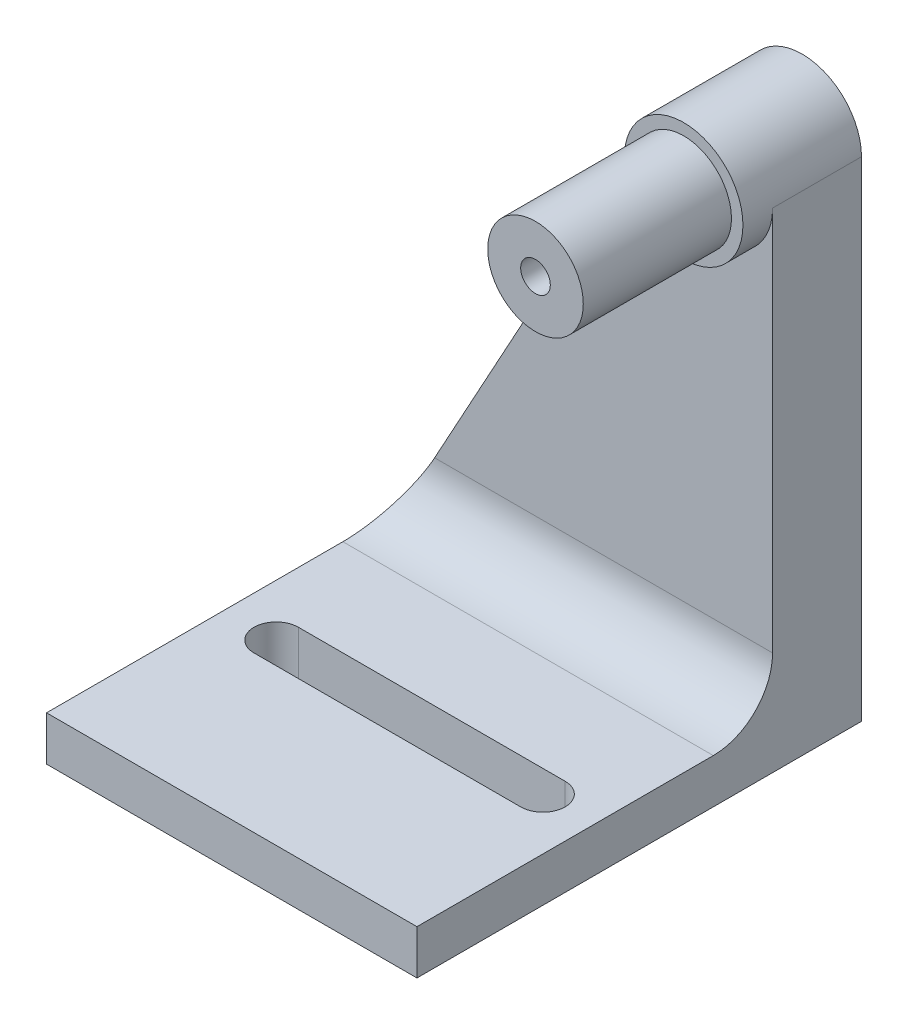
ISO-10303-21;
HEADER;
FILE_DESCRIPTION(('STEP AP214'),'2;1');
FILE_NAME('part.step','',(''),(''),'','','');
FILE_SCHEMA(('AUTOMOTIVE_DESIGN { 1 0 10303 214 1 1 1 1 }'));
ENDSEC;
DATA;
#1=APPLICATION_CONTEXT('core data for automotive mechanical design processes');
#2=APPLICATION_PROTOCOL_DEFINITION('international standard','automotive_design',2000,#1);
#3=PRODUCT_CONTEXT('',#1,'mechanical');
#4=PRODUCT('Part','Part','',(#3));
#5=PRODUCT_RELATED_PRODUCT_CATEGORY('part','',(#4));
#6=PRODUCT_DEFINITION_FORMATION('','',#4);
#7=PRODUCT_DEFINITION_CONTEXT('part definition',#1,'design');
#8=PRODUCT_DEFINITION('design','',#6,#7);
#9=PRODUCT_DEFINITION_SHAPE('','',#8);
#10=(LENGTH_UNIT() NAMED_UNIT(*) SI_UNIT(.MILLI.,.METRE.));
#11=(NAMED_UNIT(*) PLANE_ANGLE_UNIT() SI_UNIT($,.RADIAN.));
#12=(NAMED_UNIT(*) SI_UNIT($,.STERADIAN.) SOLID_ANGLE_UNIT());
#13=UNCERTAINTY_MEASURE_WITH_UNIT(LENGTH_MEASURE(1.E-05),#10,'distance_accuracy_value','');
#14=(GEOMETRIC_REPRESENTATION_CONTEXT(3) GLOBAL_UNCERTAINTY_ASSIGNED_CONTEXT((#13)) GLOBAL_UNIT_ASSIGNED_CONTEXT((#10,
#11,#12)) REPRESENTATION_CONTEXT('',''));
#15=CARTESIAN_POINT('',(0.,0.,0.));
#16=DIRECTION('',(0.,0.,1.));
#17=DIRECTION('',(1.,0.,0.));
#18=AXIS2_PLACEMENT_3D('',#15,#16,#17);
#19=CARTESIAN_POINT('',(0.,0.,6.));
#20=DIRECTION('',(-1.,0.,0.));
#21=DIRECTION('',(0.,0.,1.));
#22=AXIS2_PLACEMENT_3D('',#19,#20,#21);
#23=PLANE('',#22);
#24=DIRECTION('',(0.,1.,0.));
#25=VECTOR('',#24,1.);
#26=CARTESIAN_POINT('',(0.,0.,6.));
#27=LINE('',#26,#25);
#28=CARTESIAN_POINT('',(0.,4.,6.));
#29=VERTEX_POINT('',#28);
#30=CARTESIAN_POINT('',(0.,30.,6.));
#31=VERTEX_POINT('',#30);
#32=EDGE_CURVE('E229',#29,#31,#27,.T.);
#33=ORIENTED_EDGE('',*,*,#32,.F.);
#34=CARTESIAN_POINT('',(0.,4.,10.));
#35=DIRECTION('',(-1.,0.,0.));
#36=DIRECTION('',(0.,0.,1.));
#37=AXIS2_PLACEMENT_3D('',#34,#35,#36);
#38=CIRCLE('',#37,4.);
#39=CARTESIAN_POINT('',(0.,0.,10.));
#40=VERTEX_POINT('',#39);
#41=EDGE_CURVE('E11',#29,#40,#38,.T.);
#42=ORIENTED_EDGE('',*,*,#41,.T.);
#43=DIRECTION('',(0.,0.,-1.));
#44=VECTOR('',#43,1.);
#45=CARTESIAN_POINT('',(0.,0.,30.));
#46=LINE('',#45,#44);
#47=CARTESIAN_POINT('',(0.,0.,30.));
#48=VERTEX_POINT('',#47);
#49=EDGE_CURVE('E203',#48,#40,#46,.T.);
#50=ORIENTED_EDGE('',*,*,#49,.F.);
#51=DIRECTION('',(0.,-1.,0.));
#52=VECTOR('',#51,1.);
#53=CARTESIAN_POINT('',(0.,-3.,30.));
#54=LINE('',#53,#52);
#55=CARTESIAN_POINT('',(0.,-3.,30.));
#56=VERTEX_POINT('',#55);
#57=EDGE_CURVE('E186',#48,#56,#54,.T.);
#58=ORIENTED_EDGE('',*,*,#57,.T.);
#59=DIRECTION('',(0.,0.,-1.));
#60=VECTOR('',#59,1.);
#61=CARTESIAN_POINT('',(0.,-3.,6.));
#62=LINE('',#61,#60);
#63=CARTESIAN_POINT('',(0.,-3.,0.));
#64=VERTEX_POINT('',#63);
#65=EDGE_CURVE('E236',#56,#64,#62,.T.);
#66=ORIENTED_EDGE('',*,*,#65,.T.);
#67=DIRECTION('',(0.,1.,0.));
#68=VECTOR('',#67,1.);
#69=CARTESIAN_POINT('',(0.,0.,0.));
#70=LINE('',#69,#68);
#71=CARTESIAN_POINT('',(0.,30.,0.));
#72=VERTEX_POINT('',#71);
#73=EDGE_CURVE('E224',#64,#72,#70,.T.);
#74=ORIENTED_EDGE('',*,*,#73,.T.);
#75=DIRECTION('',(0.,0.,-1.));
#76=VECTOR('',#75,1.);
#77=CARTESIAN_POINT('',(0.,30.,6.));
#78=LINE('',#77,#76);
#79=EDGE_CURVE('E228',#31,#72,#78,.T.);
#80=ORIENTED_EDGE('',*,*,#79,.F.);
#81=EDGE_LOOP('',(#33,#42,#50,#58,#66,#74,#80));
#82=FACE_BOUND('',#81,.T.);
#83=ADVANCED_FACE('F41',(#82),#23,.F.);
#84=CARTESIAN_POINT('',(-4.,30.,6.));
#85=DIRECTION('',(0.,0.,-1.));
#86=DIRECTION('',(-1.,0.,0.));
#87=AXIS2_PLACEMENT_3D('',#84,#85,#86);
#88=CYLINDRICAL_SURFACE('',#87,4.);
#89=CARTESIAN_POINT('',(-4.,30.,0.));
#90=DIRECTION('',(0.,0.,1.));
#91=DIRECTION('',(1.,0.,0.));
#92=AXIS2_PLACEMENT_3D('',#89,#90,#91);
#93=CIRCLE('',#92,4.);
#94=CARTESIAN_POINT('',(-7.50787914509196,31.922182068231,0.));
#95=VERTEX_POINT('',#94);
#96=EDGE_CURVE('E239',#72,#95,#93,.T.);
#97=ORIENTED_EDGE('',*,*,#96,.T.);
#98=DIRECTION('',(0.,0.,-1.));
#99=VECTOR('',#98,1.);
#100=CARTESIAN_POINT('',(-7.50787914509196,31.922182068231,6.));
#101=LINE('',#100,#99);
#102=CARTESIAN_POINT('',(-7.50787914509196,31.922182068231,6.));
#103=VERTEX_POINT('',#102);
#104=EDGE_CURVE('E261',#103,#95,#101,.T.);
#105=ORIENTED_EDGE('',*,*,#104,.F.);
#106=CARTESIAN_POINT('',(-4.,30.,6.));
#107=DIRECTION('',(0.,0.,1.));
#108=DIRECTION('',(1.,0.,0.));
#109=AXIS2_PLACEMENT_3D('',#106,#107,#108);
#110=CIRCLE('',#109,4.);
#111=EDGE_CURVE('E220',#103,#31,#110,.T.);
#112=ORIENTED_EDGE('',*,*,#111,.T.);
#113=ORIENTED_EDGE('',*,*,#79,.T.);
#114=EDGE_LOOP('',(#97,#105,#112,#113));
#115=FACE_BOUND('',#114,.T.);
#116=CARTESIAN_POINT('',(-4.,30.,8.));
#117=DIRECTION('',(0.,0.,1.));
#118=DIRECTION('',(1.,0.,0.));
#119=AXIS2_PLACEMENT_3D('',#116,#117,#118);
#120=CIRCLE('',#119,4.);
#121=CARTESIAN_POINT('',(0.,30.,8.));
#122=VERTEX_POINT('',#121);
#123=EDGE_CURVE('E214',#122,#122,#120,.T.);
#124=ORIENTED_EDGE('',*,*,#123,.F.);
#125=EDGE_LOOP('',(#124));
#126=FACE_BOUND('',#125,.T.);
#127=ADVANCED_FACE('F301',(#115,#126),#88,.T.);
#128=CARTESIAN_POINT('',(-19.2269001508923,10.5355974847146,6.));
#129=DIRECTION('',(0.876969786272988,-0.480545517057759,0.));
#130=DIRECTION('',(0.480545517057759,0.876969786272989,0.));
#131=AXIS2_PLACEMENT_3D('',#128,#129,#130);
#132=PLANE('',#131);
#133=DIRECTION('',(-0.480545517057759,-0.876969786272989,0.));
#134=VECTOR('',#133,1.);
#135=CARTESIAN_POINT('',(-19.2269001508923,10.5355974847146,0.));
#136=LINE('',#135,#134);
#137=CARTESIAN_POINT('',(-25.,0.,0.));
#138=VERTEX_POINT('',#137);
#139=EDGE_CURVE('E242',#95,#138,#136,.T.);
#140=ORIENTED_EDGE('',*,*,#139,.T.);
#141=DIRECTION('',(0.,0.,-1.));
#142=VECTOR('',#141,1.);
#143=CARTESIAN_POINT('',(-25.,0.,6.));
#144=LINE('',#143,#142);
#145=CARTESIAN_POINT('',(-25.,0.,10.));
#146=VERTEX_POINT('',#145);
#147=EDGE_CURVE('E257',#146,#138,#144,.T.);
#148=ORIENTED_EDGE('',*,*,#147,.F.);
#149=CARTESIAN_POINT('',(-22.8081547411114,4.,10.));
#150=DIRECTION('',(0.876969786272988,-0.480545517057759,0.));
#151=DIRECTION('',(0.480545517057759,0.876969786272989,0.));
#152=AXIS2_PLACEMENT_3D('',#149,#150,#151);
#153=ELLIPSE('',#152,4.56116055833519,4.);
#154=CARTESIAN_POINT('',(-22.8081547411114,4.,6.));
#155=VERTEX_POINT('',#154);
#156=EDGE_CURVE('E51',#146,#155,#153,.T.);
#157=ORIENTED_EDGE('',*,*,#156,.T.);
#158=DIRECTION('',(-0.480545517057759,-0.876969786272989,0.));
#159=VECTOR('',#158,1.);
#160=CARTESIAN_POINT('',(-19.2269001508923,10.5355974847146,6.));
#161=LINE('',#160,#159);
#162=EDGE_CURVE('E232',#103,#155,#161,.T.);
#163=ORIENTED_EDGE('',*,*,#162,.F.);
#164=ORIENTED_EDGE('',*,*,#104,.T.);
#165=EDGE_LOOP('',(#140,#148,#157,#163,#164));
#166=FACE_BOUND('',#165,.T.);
#167=ADVANCED_FACE('F303',(#166),#132,.F.);
#168=CARTESIAN_POINT('',(-25.,0.,6.));
#169=DIRECTION('',(1.,0.,0.));
#170=DIRECTION('',(0.,0.,-1.));
#171=AXIS2_PLACEMENT_3D('',#168,#169,#170);
#172=PLANE('',#171);
#173=DIRECTION('',(0.,-1.,0.));
#174=VECTOR('',#173,1.);
#175=CARTESIAN_POINT('',(-25.,0.,0.));
#176=LINE('',#175,#174);
#177=CARTESIAN_POINT('',(-25.,-3.,0.));
#178=VERTEX_POINT('',#177);
#179=EDGE_CURVE('E245',#138,#178,#176,.T.);
#180=ORIENTED_EDGE('',*,*,#179,.T.);
#181=DIRECTION('',(0.,0.,-1.));
#182=VECTOR('',#181,1.);
#183=CARTESIAN_POINT('',(-25.,-3.,6.));
#184=LINE('',#183,#182);
#185=CARTESIAN_POINT('',(-25.,-3.,30.));
#186=VERTEX_POINT('',#185);
#187=EDGE_CURVE('E253',#186,#178,#184,.T.);
#188=ORIENTED_EDGE('',*,*,#187,.F.);
#189=DIRECTION('',(0.,1.,0.));
#190=VECTOR('',#189,1.);
#191=CARTESIAN_POINT('',(-25.,-3.,30.));
#192=LINE('',#191,#190);
#193=CARTESIAN_POINT('',(-25.,0.,30.));
#194=VERTEX_POINT('',#193);
#195=EDGE_CURVE('E194',#186,#194,#192,.T.);
#196=ORIENTED_EDGE('',*,*,#195,.T.);
#197=DIRECTION('',(0.,0.,-1.));
#198=VECTOR('',#197,1.);
#199=CARTESIAN_POINT('',(-25.,0.,30.));
#200=LINE('',#199,#198);
#201=EDGE_CURVE('E202',#194,#146,#200,.T.);
#202=ORIENTED_EDGE('',*,*,#201,.T.);
#203=ORIENTED_EDGE('',*,*,#147,.T.);
#204=EDGE_LOOP('',(#180,#188,#196,#202,#203));
#205=FACE_BOUND('',#204,.T.);
#206=ADVANCED_FACE('F284',(#205),#172,.F.);
#207=CARTESIAN_POINT('',(0.,-3.,6.));
#208=DIRECTION('',(0.,1.,0.));
#209=DIRECTION('',(0.,0.,1.));
#210=AXIS2_PLACEMENT_3D('',#207,#208,#209);
#211=PLANE('',#210);
#212=DIRECTION('',(-1.,0.,0.));
#213=VECTOR('',#212,1.);
#214=CARTESIAN_POINT('',(0.,-3.,16.5));
#215=LINE('',#214,#213);
#216=CARTESIAN_POINT('',(-3.5,-3.,16.5));
#217=VERTEX_POINT('',#216);
#218=CARTESIAN_POINT('',(-21.5,-3.,16.5));
#219=VERTEX_POINT('',#218);
#220=EDGE_CURVE('E170',#217,#219,#215,.T.);
#221=ORIENTED_EDGE('',*,*,#220,.T.);
#222=CARTESIAN_POINT('',(-21.5,-3.,18.));
#223=DIRECTION('',(0.,1.,0.));
#224=DIRECTION('',(0.,0.,1.));
#225=AXIS2_PLACEMENT_3D('',#222,#223,#224);
#226=CIRCLE('',#225,1.5);
#227=CARTESIAN_POINT('',(-21.5,-3.,19.5));
#228=VERTEX_POINT('',#227);
#229=EDGE_CURVE('E174',#219,#228,#226,.T.);
#230=ORIENTED_EDGE('',*,*,#229,.T.);
#231=DIRECTION('',(1.,0.,0.));
#232=VECTOR('',#231,1.);
#233=CARTESIAN_POINT('',(0.,-3.,19.5));
#234=LINE('',#233,#232);
#235=CARTESIAN_POINT('',(-3.5,-3.,19.5));
#236=VERTEX_POINT('',#235);
#237=EDGE_CURVE('E161',#228,#236,#234,.T.);
#238=ORIENTED_EDGE('',*,*,#237,.T.);
#239=CARTESIAN_POINT('',(-3.5,-3.,18.));
#240=DIRECTION('',(0.,1.,0.));
#241=DIRECTION('',(0.,0.,1.));
#242=AXIS2_PLACEMENT_3D('',#239,#240,#241);
#243=CIRCLE('',#242,1.5);
#244=EDGE_CURVE('E131',#236,#217,#243,.T.);
#245=ORIENTED_EDGE('',*,*,#244,.T.);
#246=EDGE_LOOP('',(#221,#230,#238,#245));
#247=FACE_BOUND('',#246,.T.);
#248=DIRECTION('',(1.,0.,0.));
#249=VECTOR('',#248,1.);
#250=CARTESIAN_POINT('',(0.,-3.,0.));
#251=LINE('',#250,#249);
#252=EDGE_CURVE('E233',#178,#64,#251,.T.);
#253=ORIENTED_EDGE('',*,*,#252,.T.);
#254=ORIENTED_EDGE('',*,*,#65,.F.);
#255=DIRECTION('',(-1.,0.,0.));
#256=VECTOR('',#255,1.);
#257=CARTESIAN_POINT('',(0.,-3.,30.));
#258=LINE('',#257,#256);
#259=EDGE_CURVE('E190',#56,#186,#258,.T.);
#260=ORIENTED_EDGE('',*,*,#259,.T.);
#261=ORIENTED_EDGE('',*,*,#187,.T.);
#262=EDGE_LOOP('',(#253,#254,#260,#261));
#263=FACE_BOUND('',#262,.T.);
#264=ADVANCED_FACE('F310',(#247,#263),#211,.F.);
#265=CARTESIAN_POINT('',(0.,0.,6.));
#266=DIRECTION('',(0.,0.,1.));
#267=DIRECTION('',(1.,0.,0.));
#268=AXIS2_PLACEMENT_3D('',#265,#266,#267);
#269=PLANE('',#268);
#270=ORIENTED_EDGE('',*,*,#162,.T.);
#271=DIRECTION('',(-1.,0.,0.));
#272=VECTOR('',#271,1.);
#273=CARTESIAN_POINT('',(0.,4.,6.));
#274=LINE('',#273,#272);
#275=EDGE_CURVE('E271',#155,#29,#274,.F.);
#276=ORIENTED_EDGE('',*,*,#275,.T.);
#277=ORIENTED_EDGE('',*,*,#32,.T.);
#278=ORIENTED_EDGE('',*,*,#111,.F.);
#279=EDGE_LOOP('',(#270,#276,#277,#278));
#280=FACE_BOUND('',#279,.T.);
#281=ADVANCED_FACE('F277',(#280),#269,.T.);
#282=CARTESIAN_POINT('',(0.,0.,0.));
#283=DIRECTION('',(0.,0.,1.));
#284=DIRECTION('',(1.,0.,0.));
#285=AXIS2_PLACEMENT_3D('',#282,#283,#284);
#286=PLANE('',#285);
#287=CARTESIAN_POINT('',(-4.,30.,0.));
#288=DIRECTION('',(0.,0.,1.));
#289=DIRECTION('',(1.,0.,0.));
#290=AXIS2_PLACEMENT_3D('',#287,#288,#289);
#291=CIRCLE('',#290,1.);
#292=CARTESIAN_POINT('',(-3.,30.,0.));
#293=VERTEX_POINT('',#292);
#294=EDGE_CURVE('E182',#293,#293,#291,.T.);
#295=ORIENTED_EDGE('',*,*,#294,.T.);
#296=EDGE_LOOP('',(#295));
#297=FACE_BOUND('',#296,.T.);
#298=ORIENTED_EDGE('',*,*,#96,.F.);
#299=ORIENTED_EDGE('',*,*,#73,.F.);
#300=ORIENTED_EDGE('',*,*,#252,.F.);
#301=ORIENTED_EDGE('',*,*,#179,.F.);
#302=ORIENTED_EDGE('',*,*,#139,.F.);
#303=EDGE_LOOP('',(#298,#299,#300,#301,#302));
#304=FACE_BOUND('',#303,.T.);
#305=ADVANCED_FACE('F297',(#297,#304),#286,.F.);
#306=CARTESIAN_POINT('',(-4.,30.,8.));
#307=DIRECTION('',(0.,0.,1.));
#308=DIRECTION('',(1.,0.,0.));
#309=AXIS2_PLACEMENT_3D('',#306,#307,#308);
#310=PLANE('',#309);
#311=CARTESIAN_POINT('',(-4.,30.,8.));
#312=DIRECTION('',(0.,0.,1.));
#313=DIRECTION('',(1.,0.,0.));
#314=AXIS2_PLACEMENT_3D('',#311,#312,#313);
#315=CIRCLE('',#314,3.225);
#316=CARTESIAN_POINT('',(-0.775,30.,8.));
#317=VERTEX_POINT('',#316);
#318=EDGE_CURVE('E215',#317,#317,#315,.T.);
#319=ORIENTED_EDGE('',*,*,#318,.F.);
#320=EDGE_LOOP('',(#319));
#321=FACE_BOUND('',#320,.T.);
#322=ORIENTED_EDGE('',*,*,#123,.T.);
#323=EDGE_LOOP('',(#322));
#324=FACE_BOUND('',#323,.T.);
#325=ADVANCED_FACE('F329',(#321,#324),#310,.T.);
#326=CARTESIAN_POINT('',(-4.,30.,18.));
#327=DIRECTION('',(0.,0.,-1.));
#328=DIRECTION('',(-1.,0.,0.));
#329=AXIS2_PLACEMENT_3D('',#326,#327,#328);
#330=CYLINDRICAL_SURFACE('',#329,3.225);
#331=CARTESIAN_POINT('',(-4.,30.,18.));
#332=DIRECTION('',(0.,0.,1.));
#333=DIRECTION('',(1.,0.,0.));
#334=AXIS2_PLACEMENT_3D('',#331,#332,#333);
#335=CIRCLE('',#334,3.225);
#336=CARTESIAN_POINT('',(-0.775,30.,18.));
#337=VERTEX_POINT('',#336);
#338=EDGE_CURVE('E207',#337,#337,#335,.T.);
#339=ORIENTED_EDGE('',*,*,#338,.F.);
#340=EDGE_LOOP('',(#339));
#341=FACE_BOUND('',#340,.T.);
#342=ORIENTED_EDGE('',*,*,#318,.T.);
#343=EDGE_LOOP('',(#342));
#344=FACE_BOUND('',#343,.T.);
#345=ADVANCED_FACE('F333',(#341,#344),#330,.T.);
#346=CARTESIAN_POINT('',(-4.,30.,18.));
#347=DIRECTION('',(0.,0.,1.));
#348=DIRECTION('',(1.,0.,0.));
#349=AXIS2_PLACEMENT_3D('',#346,#347,#348);
#350=PLANE('',#349);
#351=CARTESIAN_POINT('',(-4.,30.,18.));
#352=DIRECTION('',(0.,0.,1.));
#353=DIRECTION('',(1.,0.,0.));
#354=AXIS2_PLACEMENT_3D('',#351,#352,#353);
#355=CIRCLE('',#354,1.);
#356=CARTESIAN_POINT('',(-3.,30.,18.));
#357=VERTEX_POINT('',#356);
#358=EDGE_CURVE('E178',#357,#357,#355,.T.);
#359=ORIENTED_EDGE('',*,*,#358,.F.);
#360=EDGE_LOOP('',(#359));
#361=FACE_BOUND('',#360,.T.);
#362=ORIENTED_EDGE('',*,*,#338,.T.);
#363=EDGE_LOOP('',(#362));
#364=FACE_BOUND('',#363,.T.);
#365=ADVANCED_FACE('F344',(#361,#364),#350,.T.);
#366=CARTESIAN_POINT('',(0.,0.,30.));
#367=DIRECTION('',(0.,1.,0.));
#368=DIRECTION('',(-1.,0.,0.));
#369=AXIS2_PLACEMENT_3D('',#366,#367,#368);
#370=PLANE('',#369);
#371=CARTESIAN_POINT('',(-21.5,0.,18.));
#372=DIRECTION('',(0.,1.,0.));
#373=DIRECTION('',(0.,0.,1.));
#374=AXIS2_PLACEMENT_3D('',#371,#372,#373);
#375=CIRCLE('',#374,1.5);
#376=CARTESIAN_POINT('',(-21.5,0.,16.5));
#377=VERTEX_POINT('',#376);
#378=CARTESIAN_POINT('',(-21.5,0.,19.5));
#379=VERTEX_POINT('',#378);
#380=EDGE_CURVE('E146',#377,#379,#375,.T.);
#381=ORIENTED_EDGE('',*,*,#380,.F.);
#382=DIRECTION('',(-1.,0.,0.));
#383=VECTOR('',#382,1.);
#384=CARTESIAN_POINT('',(-21.5,0.,16.5));
#385=LINE('',#384,#383);
#386=CARTESIAN_POINT('',(-3.5,0.,16.5));
#387=VERTEX_POINT('',#386);
#388=EDGE_CURVE('E151',#387,#377,#385,.T.);
#389=ORIENTED_EDGE('',*,*,#388,.F.);
#390=CARTESIAN_POINT('',(-3.5,0.,18.));
#391=DIRECTION('',(0.,1.,0.));
#392=DIRECTION('',(0.,0.,1.));
#393=AXIS2_PLACEMENT_3D('',#390,#391,#392);
#394=CIRCLE('',#393,1.5);
#395=CARTESIAN_POINT('',(-3.5,0.,19.5));
#396=VERTEX_POINT('',#395);
#397=EDGE_CURVE('E128',#396,#387,#394,.T.);
#398=ORIENTED_EDGE('',*,*,#397,.F.);
#399=DIRECTION('',(1.,0.,0.));
#400=VECTOR('',#399,1.);
#401=CARTESIAN_POINT('',(-21.5,0.,19.5));
#402=LINE('',#401,#400);
#403=EDGE_CURVE('E140',#379,#396,#402,.T.);
#404=ORIENTED_EDGE('',*,*,#403,.F.);
#405=EDGE_LOOP('',(#381,#389,#398,#404));
#406=FACE_BOUND('',#405,.T.);
#407=ORIENTED_EDGE('',*,*,#49,.T.);
#408=DIRECTION('',(-1.,0.,0.));
#409=VECTOR('',#408,1.);
#410=CARTESIAN_POINT('',(-25.,0.,10.));
#411=LINE('',#410,#409);
#412=EDGE_CURVE('E219',#40,#146,#411,.T.);
#413=ORIENTED_EDGE('',*,*,#412,.T.);
#414=ORIENTED_EDGE('',*,*,#201,.F.);
#415=DIRECTION('',(1.,0.,0.));
#416=VECTOR('',#415,1.);
#417=CARTESIAN_POINT('',(0.,0.,30.));
#418=LINE('',#417,#416);
#419=EDGE_CURVE('E198',#194,#48,#418,.T.);
#420=ORIENTED_EDGE('',*,*,#419,.T.);
#421=EDGE_LOOP('',(#407,#413,#414,#420));
#422=FACE_BOUND('',#421,.T.);
#423=ADVANCED_FACE('F148',(#406,#422),#370,.T.);
#424=CARTESIAN_POINT('',(0.,0.,30.));
#425=DIRECTION('',(0.,0.,1.));
#426=DIRECTION('',(1.,0.,0.));
#427=AXIS2_PLACEMENT_3D('',#424,#425,#426);
#428=PLANE('',#427);
#429=ORIENTED_EDGE('',*,*,#57,.F.);
#430=ORIENTED_EDGE('',*,*,#419,.F.);
#431=ORIENTED_EDGE('',*,*,#195,.F.);
#432=ORIENTED_EDGE('',*,*,#259,.F.);
#433=EDGE_LOOP('',(#429,#430,#431,#432));
#434=FACE_BOUND('',#433,.T.);
#435=ADVANCED_FACE('F291',(#434),#428,.T.);
#436=CARTESIAN_POINT('',(-4.,30.,-14.));
#437=DIRECTION('',(0.,0.,1.));
#438=DIRECTION('',(1.,0.,0.));
#439=AXIS2_PLACEMENT_3D('',#436,#437,#438);
#440=CYLINDRICAL_SURFACE('',#439,1.);
#441=ORIENTED_EDGE('',*,*,#358,.T.);
#442=EDGE_LOOP('',(#441));
#443=FACE_BOUND('',#442,.T.);
#444=ORIENTED_EDGE('',*,*,#294,.F.);
#445=EDGE_LOOP('',(#444));
#446=FACE_BOUND('',#445,.T.);
#447=ADVANCED_FACE('F356',(#443,#446),#440,.F.);
#448=CARTESIAN_POINT('',(-21.5,-32.,18.));
#449=DIRECTION('',(0.,1.,0.));
#450=DIRECTION('',(0.,0.,1.));
#451=AXIS2_PLACEMENT_3D('',#448,#449,#450);
#452=CYLINDRICAL_SURFACE('',#451,1.5);
#453=DIRECTION('',(0.,1.,0.));
#454=VECTOR('',#453,1.);
#455=CARTESIAN_POINT('',(-21.5,-32.,16.5));
#456=LINE('',#455,#454);
#457=EDGE_CURVE('E158',#219,#377,#456,.T.);
#458=ORIENTED_EDGE('',*,*,#457,.T.);
#459=ORIENTED_EDGE('',*,*,#380,.T.);
#460=DIRECTION('',(0.,1.,0.));
#461=VECTOR('',#460,1.);
#462=CARTESIAN_POINT('',(-21.5,-32.,19.5));
#463=LINE('',#462,#461);
#464=EDGE_CURVE('E136',#228,#379,#463,.T.);
#465=ORIENTED_EDGE('',*,*,#464,.F.);
#466=ORIENTED_EDGE('',*,*,#229,.F.);
#467=EDGE_LOOP('',(#458,#459,#465,#466));
#468=FACE_BOUND('',#467,.T.);
#469=ADVANCED_FACE('F383',(#468),#452,.F.);
#470=CARTESIAN_POINT('',(-21.5,-32.,16.5));
#471=DIRECTION('',(0.,0.,-1.));
#472=DIRECTION('',(-1.,0.,0.));
#473=AXIS2_PLACEMENT_3D('',#470,#471,#472);
#474=PLANE('',#473);
#475=DIRECTION('',(0.,1.,0.));
#476=VECTOR('',#475,1.);
#477=CARTESIAN_POINT('',(-3.5,-32.,16.5));
#478=LINE('',#477,#476);
#479=EDGE_CURVE('E135',#217,#387,#478,.T.);
#480=ORIENTED_EDGE('',*,*,#479,.T.);
#481=ORIENTED_EDGE('',*,*,#388,.T.);
#482=ORIENTED_EDGE('',*,*,#457,.F.);
#483=ORIENTED_EDGE('',*,*,#220,.F.);
#484=EDGE_LOOP('',(#480,#481,#482,#483));
#485=FACE_BOUND('',#484,.T.);
#486=ADVANCED_FACE('F404',(#485),#474,.F.);
#487=CARTESIAN_POINT('',(-3.5,-32.,18.));
#488=DIRECTION('',(0.,1.,0.));
#489=DIRECTION('',(0.,0.,1.));
#490=AXIS2_PLACEMENT_3D('',#487,#488,#489);
#491=CYLINDRICAL_SURFACE('',#490,1.5);
#492=DIRECTION('',(0.,1.,0.));
#493=VECTOR('',#492,1.);
#494=CARTESIAN_POINT('',(-3.5,-32.,19.5));
#495=LINE('',#494,#493);
#496=EDGE_CURVE('E123',#236,#396,#495,.T.);
#497=ORIENTED_EDGE('',*,*,#496,.T.);
#498=ORIENTED_EDGE('',*,*,#397,.T.);
#499=ORIENTED_EDGE('',*,*,#479,.F.);
#500=ORIENTED_EDGE('',*,*,#244,.F.);
#501=EDGE_LOOP('',(#497,#498,#499,#500));
#502=FACE_BOUND('',#501,.T.);
#503=ADVANCED_FACE('F125',(#502),#491,.F.);
#504=CARTESIAN_POINT('',(-21.5,-32.,19.5));
#505=DIRECTION('',(0.,0.,1.));
#506=DIRECTION('',(1.,0.,0.));
#507=AXIS2_PLACEMENT_3D('',#504,#505,#506);
#508=PLANE('',#507);
#509=ORIENTED_EDGE('',*,*,#464,.T.);
#510=ORIENTED_EDGE('',*,*,#403,.T.);
#511=ORIENTED_EDGE('',*,*,#496,.F.);
#512=ORIENTED_EDGE('',*,*,#237,.F.);
#513=EDGE_LOOP('',(#509,#510,#511,#512));
#514=FACE_BOUND('',#513,.T.);
#515=ADVANCED_FACE('F141',(#514),#508,.F.);
#516=CARTESIAN_POINT('',(0.,4.,10.));
#517=DIRECTION('',(1.,0.,0.));
#518=DIRECTION('',(0.,1.,0.));
#519=AXIS2_PLACEMENT_3D('',#516,#517,#518);
#520=CYLINDRICAL_SURFACE('',#519,4.);
#521=ORIENTED_EDGE('',*,*,#41,.F.);
#522=ORIENTED_EDGE('',*,*,#275,.F.);
#523=ORIENTED_EDGE('',*,*,#156,.F.);
#524=ORIENTED_EDGE('',*,*,#412,.F.);
#525=EDGE_LOOP('',(#521,#522,#523,#524));
#526=FACE_BOUND('',#525,.T.);
#527=ADVANCED_FACE('F43',(#526),#520,.F.);
#528=CLOSED_SHELL('',(#83,#127,#167,#206,#264,#281,#305,#325,#345,#365,#423,#435,#447,#469,#486,
#503,#515,#527));
#529=MANIFOLD_SOLID_BREP('B2',#528);
#530=ADVANCED_BREP_SHAPE_REPRESENTATION('',(#18,#529),#14);
#531=SHAPE_DEFINITION_REPRESENTATION(#9,#530);
ENDSEC;
END-ISO-10303-21;
